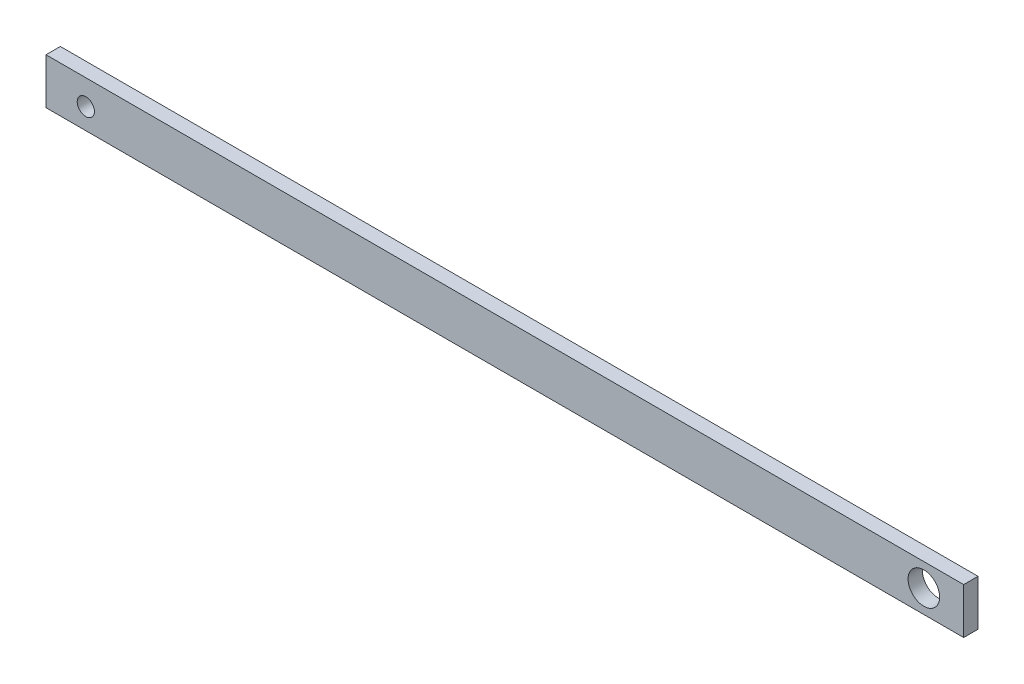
from build123d import *

# Parameters (mm, degrees)
SKETCH1_W           = 160
SKETCH1_H           = 8
BOSS_EXTRUDE1_DEPTH = 2.5
SKETCH2_R           = 1.5
SKETCH2_R_2         = 2.75
CUT_EXTRUDE1_DEPTH  = 2.5


with BuildPart() as part:
    # Sketch1 → Boss-Extrude1 (new body)
    with BuildSketch(Plane.XY):
        with Locations((80, 4)):
            Rectangle(SKETCH1_W, SKETCH1_H)
    extrude(amount=BOSS_EXTRUDE1_DEPTH)

    # Sketch2 → Cut-Extrude1 (cut)
    with BuildSketch(Plane.XY.offset(2.5)):
        with Locations((6.94, 3.633488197)):
            Circle(SKETCH2_R)
        with Locations((153.06, 4)):
            Circle(SKETCH2_R_2)
    extrude(amount=-CUT_EXTRUDE1_DEPTH, mode=Mode.SUBTRACT)


solid = part.part
